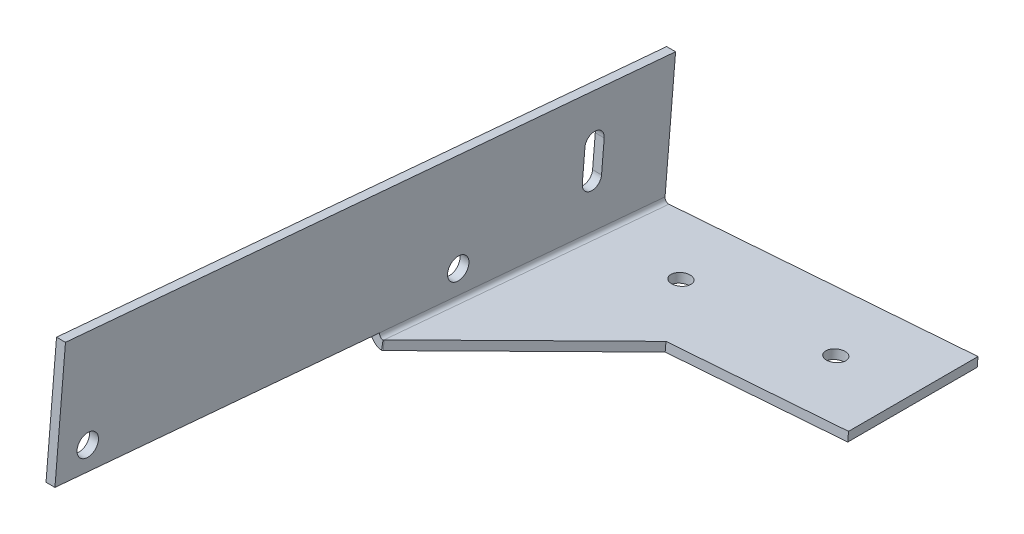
ISO-10303-21;
HEADER;
FILE_DESCRIPTION(('STEP AP214'),'2;1');
FILE_NAME('part.step','',(''),(''),'','','');
FILE_SCHEMA(('AUTOMOTIVE_DESIGN { 1 0 10303 214 1 1 1 1 }'));
ENDSEC;
DATA;
#1=APPLICATION_CONTEXT('core data for automotive mechanical design processes');
#2=APPLICATION_PROTOCOL_DEFINITION('international standard','automotive_design',2000,#1);
#3=PRODUCT_CONTEXT('',#1,'mechanical');
#4=PRODUCT('Part','Part','',(#3));
#5=PRODUCT_RELATED_PRODUCT_CATEGORY('part','',(#4));
#6=PRODUCT_DEFINITION_FORMATION('','',#4);
#7=PRODUCT_DEFINITION_CONTEXT('part definition',#1,'design');
#8=PRODUCT_DEFINITION('design','',#6,#7);
#9=PRODUCT_DEFINITION_SHAPE('','',#8);
#10=(LENGTH_UNIT() NAMED_UNIT(*) SI_UNIT(.MILLI.,.METRE.));
#11=(NAMED_UNIT(*) PLANE_ANGLE_UNIT() SI_UNIT($,.RADIAN.));
#12=(NAMED_UNIT(*) SI_UNIT($,.STERADIAN.) SOLID_ANGLE_UNIT());
#13=UNCERTAINTY_MEASURE_WITH_UNIT(LENGTH_MEASURE(1.E-05),#10,'distance_accuracy_value','');
#14=(GEOMETRIC_REPRESENTATION_CONTEXT(3) GLOBAL_UNCERTAINTY_ASSIGNED_CONTEXT((#13)) GLOBAL_UNIT_ASSIGNED_CONTEXT((#10,
#11,#12)) REPRESENTATION_CONTEXT('',''));
#15=CARTESIAN_POINT('',(0.,0.,0.));
#16=DIRECTION('',(0.,0.,1.));
#17=DIRECTION('',(1.,0.,0.));
#18=AXIS2_PLACEMENT_3D('',#15,#16,#17);
#19=CARTESIAN_POINT('',(0.,42.434925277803,1.32205070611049));
#20=DIRECTION('',(0.,0.0871557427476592,0.996194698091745));
#21=DIRECTION('',(0.,0.996194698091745,-0.0871557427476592));
#22=AXIS2_PLACEMENT_3D('',#19,#20,#21);
#23=PLANE('',#22);
#24=DIRECTION('',(1.,0.,0.));
#25=VECTOR('',#24,1.);
#26=CARTESIAN_POINT('',(0.,36.994706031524,1.79800821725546));
#27=LINE('',#26,#25);
#28=CARTESIAN_POINT('',(-1.5875,36.994706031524,1.79800821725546));
#29=VERTEX_POINT('',#28);
#30=CARTESIAN_POINT('',(0.,36.994706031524,1.79800821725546));
#31=VERTEX_POINT('',#30);
#32=EDGE_CURVE('E11',#29,#31,#27,.T.);
#33=ORIENTED_EDGE('',*,*,#32,.F.);
#34=DIRECTION('',(0.,0.996194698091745,-0.0871557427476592));
#35=VECTOR('',#34,1.);
#36=CARTESIAN_POINT('',(-1.5875,42.434925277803,1.32205070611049));
#37=LINE('',#36,#35);
#38=CARTESIAN_POINT('',(-1.5875,42.434925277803,1.32205070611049));
#39=VERTEX_POINT('',#38);
#40=EDGE_CURVE('E296',#29,#39,#37,.T.);
#41=ORIENTED_EDGE('',*,*,#40,.T.);
#42=DIRECTION('',(1.,0.,0.));
#43=VECTOR('',#42,1.);
#44=CARTESIAN_POINT('',(0.,42.434925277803,1.32205070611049));
#45=LINE('',#44,#43);
#46=CARTESIAN_POINT('',(0.,42.434925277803,1.32205070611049));
#47=VERTEX_POINT('',#46);
#48=EDGE_CURVE('E55',#39,#47,#45,.T.);
#49=ORIENTED_EDGE('',*,*,#48,.T.);
#50=DIRECTION('',(0.,0.996194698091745,-0.0871557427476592));
#51=VECTOR('',#50,1.);
#52=CARTESIAN_POINT('',(0.,42.434925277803,1.32205070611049));
#53=LINE('',#52,#51);
#54=EDGE_CURVE('E436',#31,#47,#53,.T.);
#55=ORIENTED_EDGE('',*,*,#54,.F.);
#56=EDGE_LOOP('',(#33,#41,#49,#55));
#57=FACE_BOUND('',#56,.T.);
#58=ADVANCED_FACE('F45',(#57),#23,.F.);
#59=CARTESIAN_POINT('',(0.,42.2854967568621,-0.385925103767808));
#60=DIRECTION('',(-1.,0.,0.));
#61=DIRECTION('',(0.,0.,1.));
#62=AXIS2_PLACEMENT_3D('',#59,#60,#61);
#63=CYLINDRICAL_SURFACE('',#62,1.7145);
#64=ORIENTED_EDGE('',*,*,#48,.F.);
#65=CARTESIAN_POINT('',(-1.5875,42.2854967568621,-0.385925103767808));
#66=DIRECTION('',(-1.,0.,0.));
#67=DIRECTION('',(0.,0.,1.));
#68=AXIS2_PLACEMENT_3D('',#65,#66,#67);
#69=CIRCLE('',#68,1.7145);
#70=CARTESIAN_POINT('',(-1.5875,42.1360682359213,-2.0939009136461));
#71=VERTEX_POINT('',#70);
#72=EDGE_CURVE('E237',#39,#71,#69,.T.);
#73=ORIENTED_EDGE('',*,*,#72,.T.);
#74=DIRECTION('',(1.,0.,0.));
#75=VECTOR('',#74,1.);
#76=CARTESIAN_POINT('',(0.,42.1360682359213,-2.0939009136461));
#77=LINE('',#76,#75);
#78=CARTESIAN_POINT('',(0.,42.1360682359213,-2.0939009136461));
#79=VERTEX_POINT('',#78);
#80=EDGE_CURVE('E497',#71,#79,#77,.T.);
#81=ORIENTED_EDGE('',*,*,#80,.T.);
#82=CARTESIAN_POINT('',(0.,42.2854967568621,-0.385925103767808));
#83=DIRECTION('',(-1.,0.,0.));
#84=DIRECTION('',(0.,0.,1.));
#85=AXIS2_PLACEMENT_3D('',#82,#83,#84);
#86=CIRCLE('',#85,1.7145);
#87=EDGE_CURVE('E433',#47,#79,#86,.T.);
#88=ORIENTED_EDGE('',*,*,#87,.F.);
#89=EDGE_LOOP('',(#64,#73,#81,#88));
#90=FACE_BOUND('',#89,.T.);
#91=ADVANCED_FACE('F577',(#90),#63,.F.);
#92=CARTESIAN_POINT('',(0.,42.1360682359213,-2.0939009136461));
#93=DIRECTION('',(0.,-0.0871557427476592,-0.996194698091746));
#94=DIRECTION('',(0.,-0.996194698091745,0.0871557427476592));
#95=AXIS2_PLACEMENT_3D('',#92,#93,#94);
#96=PLANE('',#95);
#97=ORIENTED_EDGE('',*,*,#80,.F.);
#98=DIRECTION('',(0.,-0.996194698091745,0.0871557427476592));
#99=VECTOR('',#98,1.);
#100=CARTESIAN_POINT('',(-1.5875,42.1360682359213,-2.0939009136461));
#101=LINE('',#100,#99);
#102=CARTESIAN_POINT('',(-1.5875,36.6958489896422,-1.61794340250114));
#103=VERTEX_POINT('',#102);
#104=EDGE_CURVE('E289',#71,#103,#101,.T.);
#105=ORIENTED_EDGE('',*,*,#104,.T.);
#106=DIRECTION('',(1.,0.,0.));
#107=VECTOR('',#106,1.);
#108=CARTESIAN_POINT('',(0.,36.6958489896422,-1.61794340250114));
#109=LINE('',#108,#107);
#110=CARTESIAN_POINT('',(0.,36.6958489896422,-1.61794340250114));
#111=VERTEX_POINT('',#110);
#112=EDGE_CURVE('E119',#103,#111,#109,.T.);
#113=ORIENTED_EDGE('',*,*,#112,.T.);
#114=DIRECTION('',(0.,-0.996194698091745,0.0871557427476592));
#115=VECTOR('',#114,1.);
#116=CARTESIAN_POINT('',(0.,42.1360682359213,-2.0939009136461));
#117=LINE('',#116,#115);
#118=EDGE_CURVE('E313',#79,#111,#117,.T.);
#119=ORIENTED_EDGE('',*,*,#118,.F.);
#120=EDGE_LOOP('',(#97,#105,#113,#119));
#121=FACE_BOUND('',#120,.T.);
#122=ADVANCED_FACE('F581',(#121),#96,.F.);
#123=CARTESIAN_POINT('',(23.6204584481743,28.9903247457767,10.5602283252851));
#124=DIRECTION('',(0.76604444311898,0.0560226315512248,0.640341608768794));
#125=DIRECTION('',(-0.642787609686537,0.0667651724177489,0.763129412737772));
#126=AXIS2_PLACEMENT_3D('',#123,#124,#125);
#127=PLANE('',#126);
#128=CARTESIAN_POINT('',(0.7366,29.78577015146,37.8667306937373));
#129=CARTESIAN_POINT('',(0.7366,31.3672292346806,37.7283709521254));
#130=B_SPLINE_CURVE_WITH_KNOTS('',1,(#128,#129),.UNSPECIFIED.,.F.,.F.,(2,2),(0.,1.),.UNSPECIFIED.);
#131=CARTESIAN_POINT('',(0.736600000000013,29.78577015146,37.8667306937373));
#132=VERTEX_POINT('',#131);
#133=CARTESIAN_POINT('',(0.736600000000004,31.3672292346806,37.7283709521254));
#134=VERTEX_POINT('',#133);
#135=EDGE_CURVE('E172',#132,#134,#130,.T.);
#136=ORIENTED_EDGE('',*,*,#135,.F.);
#137=DIRECTION('',(-0.642787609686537,0.0667651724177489,0.763129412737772));
#138=VECTOR('',#137,1.);
#139=CARTESIAN_POINT('',(23.6204584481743,27.4088656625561,10.698588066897));
#140=LINE('',#139,#138);
#141=CARTESIAN_POINT('',(23.6204584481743,27.4088656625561,10.698588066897));
#142=VERTEX_POINT('',#141);
#143=EDGE_CURVE('E288',#142,#132,#140,.T.);
#144=ORIENTED_EDGE('',*,*,#143,.F.);
#145=DIRECTION('',(0.,0.996194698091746,-0.0871557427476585));
#146=VECTOR('',#145,1.);
#147=CARTESIAN_POINT('',(23.6204584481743,28.9903247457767,10.5602283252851));
#148=LINE('',#147,#146);
#149=CARTESIAN_POINT('',(23.6204584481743,28.9903247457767,10.5602283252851));
#150=VERTEX_POINT('',#149);
#151=EDGE_CURVE('E186',#142,#150,#148,.T.);
#152=ORIENTED_EDGE('',*,*,#151,.T.);
#153=DIRECTION('',(-0.642787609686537,0.0667651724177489,0.763129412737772));
#154=VECTOR('',#153,1.);
#155=CARTESIAN_POINT('',(23.6204584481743,28.9903247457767,10.5602283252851));
#156=LINE('',#155,#154);
#157=EDGE_CURVE('E203',#150,#134,#156,.T.);
#158=ORIENTED_EDGE('',*,*,#157,.T.);
#159=EDGE_LOOP('',(#136,#144,#152,#158));
#160=FACE_BOUND('',#159,.T.);
#161=ADVANCED_FACE('F204',(#160),#127,.T.);
#162=CARTESIAN_POINT('',(53.4391783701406,28.7629528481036,7.96135564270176));
#163=DIRECTION('',(0.0871557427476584,0.0868240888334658,0.992403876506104));
#164=DIRECTION('',(-0.996194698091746,0.00759612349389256,0.0868240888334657));
#165=AXIS2_PLACEMENT_3D('',#162,#163,#164);
#166=PLANE('',#165);
#167=ORIENTED_EDGE('',*,*,#151,.F.);
#168=DIRECTION('',(0.996194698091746,-0.00759612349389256,-0.0868240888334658));
#169=VECTOR('',#168,1.);
#170=CARTESIAN_POINT('',(28.1358330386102,27.3744353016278,10.3050472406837));
#171=LINE('',#170,#169);
#172=CARTESIAN_POINT('',(53.4391783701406,27.1814937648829,8.09971538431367));
#173=VERTEX_POINT('',#172);
#174=EDGE_CURVE('E322',#173,#142,#171,.F.);
#175=ORIENTED_EDGE('',*,*,#174,.F.);
#176=DIRECTION('',(0.,0.996194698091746,-0.0871557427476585));
#177=VECTOR('',#176,1.);
#178=CARTESIAN_POINT('',(53.4391783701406,28.7629528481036,7.96135564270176));
#179=LINE('',#178,#177);
#180=CARTESIAN_POINT('',(53.4391783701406,28.7629528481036,7.96135564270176));
#181=VERTEX_POINT('',#180);
#182=EDGE_CURVE('E402',#173,#181,#179,.T.);
#183=ORIENTED_EDGE('',*,*,#182,.T.);
#184=DIRECTION('',(-0.996194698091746,0.00759612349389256,0.0868240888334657));
#185=VECTOR('',#184,1.);
#186=CARTESIAN_POINT('',(53.4391783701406,28.7629528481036,7.96135564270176));
#187=LINE('',#186,#185);
#188=EDGE_CURVE('E208',#181,#150,#187,.T.);
#189=ORIENTED_EDGE('',*,*,#188,.T.);
#190=EDGE_LOOP('',(#167,#175,#183,#189));
#191=FACE_BOUND('',#190,.T.);
#192=ADVANCED_FACE('F405',(#191),#166,.T.);
#193=CARTESIAN_POINT('',(51.22542250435,26.5576209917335,-17.2457028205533));
#194=DIRECTION('',(0.996194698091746,-0.00759612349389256,-0.0868240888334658));
#195=DIRECTION('',(0.0871557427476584,0.0868240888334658,0.992403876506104));
#196=AXIS2_PLACEMENT_3D('',#193,#194,#195);
#197=PLANE('',#196);
#198=ORIENTED_EDGE('',*,*,#182,.F.);
#199=DIRECTION('',(-0.0871557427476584,-0.0868240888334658,-0.992403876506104));
#200=VECTOR('',#199,1.);
#201=CARTESIAN_POINT('',(52.3323004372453,26.0788278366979,-4.50381384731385));
#202=LINE('',#201,#200);
#203=CARTESIAN_POINT('',(51.2254225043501,24.9761619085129,-17.1073430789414));
#204=VERTEX_POINT('',#203);
#205=EDGE_CURVE('E255',#204,#173,#202,.F.);
#206=ORIENTED_EDGE('',*,*,#205,.F.);
#207=DIRECTION('',(0.,0.996194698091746,-0.0871557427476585));
#208=VECTOR('',#207,1.);
#209=CARTESIAN_POINT('',(51.22542250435,26.5576209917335,-17.2457028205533));
#210=LINE('',#209,#208);
#211=CARTESIAN_POINT('',(51.22542250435,26.5576209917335,-17.2457028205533));
#212=VERTEX_POINT('',#211);
#213=EDGE_CURVE('E395',#204,#212,#210,.T.);
#214=ORIENTED_EDGE('',*,*,#213,.T.);
#215=DIRECTION('',(0.0871557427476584,0.0868240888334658,0.992403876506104));
#216=VECTOR('',#215,1.);
#217=CARTESIAN_POINT('',(51.22542250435,26.5576209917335,-17.2457028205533));
#218=LINE('',#217,#216);
#219=EDGE_CURVE('E218',#212,#181,#218,.T.);
#220=ORIENTED_EDGE('',*,*,#219,.T.);
#221=EDGE_LOOP('',(#198,#206,#214,#220));
#222=FACE_BOUND('',#221,.T.);
#223=ADVANCED_FACE('F412',(#222),#197,.T.);
#224=CARTESIAN_POINT('',(51.22542250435,26.5576209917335,-17.2457028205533));
#225=DIRECTION('',(-0.0871557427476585,-0.0868240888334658,-0.992403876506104));
#226=DIRECTION('',(0.996194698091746,-0.00759612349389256,-0.0868240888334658));
#227=AXIS2_PLACEMENT_3D('',#224,#225,#226);
#228=PLANE('',#227);
#229=ORIENTED_EDGE('',*,*,#213,.F.);
#230=DIRECTION('',(0.996194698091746,-0.00759612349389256,-0.0868240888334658));
#231=VECTOR('',#230,1.);
#232=CARTESIAN_POINT('',(25.9220771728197,25.1691034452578,-14.9020112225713));
#233=LINE('',#232,#231);
#234=CARTESIAN_POINT('',(0.736599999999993,25.3611462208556,-12.70695225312));
#235=VERTEX_POINT('',#234);
#236=EDGE_CURVE('E303',#235,#204,#233,.T.);
#237=ORIENTED_EDGE('',*,*,#236,.F.);
#238=CARTESIAN_POINT('',(0.7366,26.9426053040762,-12.845311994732));
#239=CARTESIAN_POINT('',(0.7366,25.3611462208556,-12.7069522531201));
#240=B_SPLINE_CURVE_WITH_KNOTS('',1,(#238,#239),.UNSPECIFIED.,.F.,.F.,(2,2),(0.,1.),.UNSPECIFIED.);
#241=CARTESIAN_POINT('',(0.736599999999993,26.9426053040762,-12.8453119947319));
#242=VERTEX_POINT('',#241);
#243=EDGE_CURVE('E383',#235,#242,#240,.F.);
#244=ORIENTED_EDGE('',*,*,#243,.T.);
#245=DIRECTION('',(0.996194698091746,-0.00759612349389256,-0.0868240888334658));
#246=VECTOR('',#245,1.);
#247=CARTESIAN_POINT('',(51.22542250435,26.5576209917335,-17.2457028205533));
#248=LINE('',#247,#246);
#249=EDGE_CURVE('E215',#242,#212,#248,.T.);
#250=ORIENTED_EDGE('',*,*,#249,.T.);
#251=EDGE_LOOP('',(#229,#237,#244,#250));
#252=FACE_BOUND('',#251,.T.);
#253=ADVANCED_FACE('F344',(#252),#228,.T.);
#254=CARTESIAN_POINT('',(0.7366,25.3611462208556,-12.7069522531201));
#255=CARTESIAN_POINT('',(0.676932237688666,25.3614458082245,-12.7035279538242));
#256=CARTESIAN_POINT('',(0.61726470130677,25.3640355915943,-12.7003040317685));
#257=CARTESIAN_POINT('',(0.557773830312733,25.3689088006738,-12.6972798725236));
#258=CARTESIAN_POINT('',(0.7366,26.9426053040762,-12.845311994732));
#259=CARTESIAN_POINT('',(0.717688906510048,26.942904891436,-12.8418876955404));
#260=CARTESIAN_POINT('',(0.698777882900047,26.943930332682,-12.8385269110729));
#261=CARTESIAN_POINT('',(0.679922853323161,26.9456794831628,-12.8352294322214));
#262=B_SPLINE_SURFACE_WITH_KNOTS('',1,3,((#254,#255,#256,#257),(#258,#259,#260,#261)),
.UNSPECIFIED.,.F.,.F.,.F.,(2,2),(4,4),(0.,1.),(0.,1.),.UNSPECIFIED.);
#263=CARTESIAN_POINT('',(0.7366,25.3611462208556,-12.7069522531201));
#264=CARTESIAN_POINT('',(0.676932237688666,25.3614458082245,-12.7035279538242));
#265=CARTESIAN_POINT('',(0.61726470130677,25.3640355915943,-12.7003040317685));
#266=CARTESIAN_POINT('',(0.557773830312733,25.3689088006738,-12.6972798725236));
#267=B_SPLINE_CURVE_WITH_KNOTS('',3,(#263,#264,#265,#266),.UNSPECIFIED.,.F.,.F.,(4,4),(0.,1.),.UNSPECIFIED.);
#268=CARTESIAN_POINT('',(0.557773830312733,25.3689088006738,-12.6972798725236));
#269=VERTEX_POINT('',#268);
#270=EDGE_CURVE('E249',#235,#269,#267,.T.);
#271=CARTESIAN_POINT('',(0.557773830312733,25.3689088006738,-12.6972798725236));
#272=CARTESIAN_POINT('',(0.679922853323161,26.9456794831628,-12.8352294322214));
#273=B_SPLINE_CURVE_WITH_KNOTS('',1,(#271,#272),.UNSPECIFIED.,.F.,.F.,(2,2),(0.,1.),.UNSPECIFIED.);
#274=CARTESIAN_POINT('',(0.679922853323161,26.9456794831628,-12.8352294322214));
#275=VERTEX_POINT('',#274);
#276=EDGE_CURVE('E64',#269,#275,#273,.T.);
#277=CARTESIAN_POINT('',(0.679922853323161,26.9456794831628,-12.8352294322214));
#278=CARTESIAN_POINT('',(0.698777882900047,26.943930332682,-12.8385269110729));
#279=CARTESIAN_POINT('',(0.717688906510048,26.942904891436,-12.8418876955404));
#280=CARTESIAN_POINT('',(0.7366,26.9426053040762,-12.845311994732));
#281=B_SPLINE_CURVE_WITH_KNOTS('',3,(#277,#278,#279,#280),.UNSPECIFIED.,.F.,.F.,(4,4),(0.,1.),.UNSPECIFIED.);
#282=EDGE_CURVE('E199',#242,#275,#281,.F.);
#283=ORIENTED_EDGE('',*,*,#243,.F.);
#284=ORIENTED_EDGE('',*,*,#270,.T.);
#285=ORIENTED_EDGE('',*,*,#276,.T.);
#286=ORIENTED_EDGE('',*,*,#282,.F.);
#287=EDGE_LOOP('',(#283,#284,#285,#286));
#288=FACE_BOUND('',#287,.T.);
#289=ADVANCED_FACE('F331',(#288),#262,.F.);
#290=CARTESIAN_POINT('',(0.7366,27.6773010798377,-12.8992380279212));
#291=DIRECTION('',(0.,-0.0871557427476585,-0.996194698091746));
#292=DIRECTION('',(0.,0.996194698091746,-0.0871557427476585));
#293=AXIS2_PLACEMENT_3D('',#290,#291,#292);
#294=PLANE('',#293);
#295=ORIENTED_EDGE('',*,*,#276,.F.);
#296=CARTESIAN_POINT('',(0.7366,27.6773010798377,-12.8992380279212));
#297=DIRECTION('',(0.,-0.0871557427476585,-0.996194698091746));
#298=DIRECTION('',(0.,0.996194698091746,-0.0871557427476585));
#299=AXIS2_PLACEMENT_3D('',#296,#297,#298);
#300=CIRCLE('',#299,2.3241);
#301=CARTESIAN_POINT('',(-1.5875,27.6773010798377,-12.8992380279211));
#302=VERTEX_POINT('',#301);
#303=EDGE_CURVE('E310',#269,#302,#300,.T.);
#304=ORIENTED_EDGE('',*,*,#303,.T.);
#305=DIRECTION('',(1.,0.,0.));
#306=VECTOR('',#305,1.);
#307=CARTESIAN_POINT('',(0.,27.6773010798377,-12.8992380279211));
#308=LINE('',#307,#306);
#309=CARTESIAN_POINT('',(0.,27.6773010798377,-12.8992380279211));
#310=VERTEX_POINT('',#309);
#311=EDGE_CURVE('E459',#302,#310,#308,.T.);
#312=ORIENTED_EDGE('',*,*,#311,.T.);
#313=CARTESIAN_POINT('',(0.7366,27.6773010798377,-12.8992380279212));
#314=DIRECTION('',(0.,0.0871557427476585,0.996194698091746));
#315=DIRECTION('',(0.,-0.996194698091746,0.0871557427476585));
#316=AXIS2_PLACEMENT_3D('',#313,#314,#315);
#317=CIRCLE('',#316,0.7366);
#318=EDGE_CURVE('E227',#275,#310,#317,.F.);
#319=ORIENTED_EDGE('',*,*,#318,.F.);
#320=EDGE_LOOP('',(#295,#304,#312,#319));
#321=FACE_BOUND('',#320,.T.);
#322=ADVANCED_FACE('F343',(#321),#294,.T.);
#323=CARTESIAN_POINT('',(0.,25.4,-12.7));
#324=DIRECTION('',(0.,-0.0871557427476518,-0.996194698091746));
#325=DIRECTION('',(0.,-0.996194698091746,0.0871557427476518));
#326=AXIS2_PLACEMENT_3D('',#323,#324,#325);
#327=PLANE('',#326);
#328=ORIENTED_EDGE('',*,*,#311,.F.);
#329=DIRECTION('',(0.,-0.996194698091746,0.0871557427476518));
#330=VECTOR('',#329,1.);
#331=CARTESIAN_POINT('',(-1.5875,25.4,-12.7));
#332=LINE('',#331,#330);
#333=CARTESIAN_POINT('',(-1.5875,49.0586278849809,-14.769861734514));
#334=VERTEX_POINT('',#333);
#335=EDGE_CURVE('E236',#334,#302,#332,.T.);
#336=ORIENTED_EDGE('',*,*,#335,.F.);
#337=DIRECTION('',(1.,0.,0.));
#338=VECTOR('',#337,1.);
#339=CARTESIAN_POINT('',(0.,49.0586278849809,-14.769861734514));
#340=LINE('',#339,#338);
#341=CARTESIAN_POINT('',(0.,49.0586278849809,-14.769861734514));
#342=VERTEX_POINT('',#341);
#343=EDGE_CURVE('E462',#334,#342,#340,.T.);
#344=ORIENTED_EDGE('',*,*,#343,.T.);
#345=DIRECTION('',(0.,-0.996194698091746,0.0871557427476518));
#346=VECTOR('',#345,1.);
#347=CARTESIAN_POINT('',(0.,25.4,-12.7));
#348=LINE('',#347,#346);
#349=EDGE_CURVE('E427',#342,#310,#348,.T.);
#350=ORIENTED_EDGE('',*,*,#349,.T.);
#351=EDGE_LOOP('',(#328,#336,#344,#350));
#352=FACE_BOUND('',#351,.T.);
#353=ADVANCED_FACE('F464',(#352),#327,.T.);
#354=CARTESIAN_POINT('',(0.,49.0586278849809,-14.769861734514));
#355=DIRECTION('',(0.,0.996194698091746,-0.0871557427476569));
#356=DIRECTION('',(0.,-0.0871557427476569,-0.996194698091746));
#357=AXIS2_PLACEMENT_3D('',#354,#355,#356);
#358=PLANE('',#357);
#359=ORIENTED_EDGE('',*,*,#343,.F.);
#360=DIRECTION('',(0.,-0.0871557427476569,-0.996194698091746));
#361=VECTOR('',#360,1.);
#362=CARTESIAN_POINT('',(-1.5875,49.0586278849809,-14.769861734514));
#363=LINE('',#362,#361);
#364=CARTESIAN_POINT('',(-1.5875,58.5374919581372,93.5740503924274));
#365=VERTEX_POINT('',#364);
#366=EDGE_CURVE('E240',#365,#334,#363,.T.);
#367=ORIENTED_EDGE('',*,*,#366,.F.);
#368=DIRECTION('',(1.,0.,0.));
#369=VECTOR('',#368,1.);
#370=CARTESIAN_POINT('',(-1.5875,58.5374919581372,93.5740503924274));
#371=LINE('',#370,#369);
#372=CARTESIAN_POINT('',(0.,58.5374919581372,93.5740503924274));
#373=VERTEX_POINT('',#372);
#374=EDGE_CURVE('E472',#365,#373,#371,.T.);
#375=ORIENTED_EDGE('',*,*,#374,.T.);
#376=DIRECTION('',(0.,-0.0871557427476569,-0.996194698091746));
#377=VECTOR('',#376,1.);
#378=CARTESIAN_POINT('',(0.,49.0586278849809,-14.769861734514));
#379=LINE('',#378,#377);
#380=EDGE_CURVE('E424',#373,#342,#379,.T.);
#381=ORIENTED_EDGE('',*,*,#380,.T.);
#382=EDGE_LOOP('',(#359,#367,#375,#381));
#383=FACE_BOUND('',#382,.T.);
#384=ADVANCED_FACE('F470',(#383),#358,.T.);
#385=CARTESIAN_POINT('',(0.,32.2239567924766,39.0692745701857));
#386=DIRECTION('',(0.,-0.996194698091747,0.0871557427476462));
#387=DIRECTION('',(0.,0.0871557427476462,0.996194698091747));
#388=AXIS2_PLACEMENT_3D('',#385,#386,#387);
#389=PLANE('',#388);
#390=DIRECTION('',(0.,0.0871557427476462,0.996194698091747));
#391=VECTOR('',#390,1.);
#392=CARTESIAN_POINT('',(0.,32.2239567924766,39.0692745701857));
#393=LINE('',#392,#391);
#394=CARTESIAN_POINT('',(0.,32.1132689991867,37.8041073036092));
#395=VERTEX_POINT('',#394);
#396=CARTESIAN_POINT('',(0.,37.156165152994,95.4446740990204));
#397=VERTEX_POINT('',#396);
#398=EDGE_CURVE('E422',#395,#397,#393,.T.);
#399=ORIENTED_EDGE('',*,*,#398,.T.);
#400=DIRECTION('',(1.,0.,0.));
#401=VECTOR('',#400,1.);
#402=CARTESIAN_POINT('',(-1.5875,37.156165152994,95.4446740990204));
#403=LINE('',#402,#401);
#404=CARTESIAN_POINT('',(-1.5875,37.156165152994,95.4446740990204));
#405=VERTEX_POINT('',#404);
#406=EDGE_CURVE('E293',#405,#397,#403,.T.);
#407=ORIENTED_EDGE('',*,*,#406,.F.);
#408=DIRECTION('',(0.,0.0871557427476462,0.996194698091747));
#409=VECTOR('',#408,1.);
#410=CARTESIAN_POINT('',(-1.5875,32.2239567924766,39.0692745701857));
#411=LINE('',#410,#409);
#412=CARTESIAN_POINT('',(-1.5875,32.1132689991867,37.8041073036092));
#413=VERTEX_POINT('',#412);
#414=EDGE_CURVE('E128',#413,#405,#411,.T.);
#415=ORIENTED_EDGE('',*,*,#414,.F.);
#416=DIRECTION('',(1.,0.,0.));
#417=VECTOR('',#416,1.);
#418=CARTESIAN_POINT('',(0.,32.1132689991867,37.8041073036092));
#419=LINE('',#418,#417);
#420=EDGE_CURVE('E795',#413,#395,#419,.T.);
#421=ORIENTED_EDGE('',*,*,#420,.T.);
#422=EDGE_LOOP('',(#399,#407,#415,#421));
#423=FACE_BOUND('',#422,.T.);
#424=ADVANCED_FACE('F566',(#423),#389,.T.);
#425=CARTESIAN_POINT('',(0.7366,32.1132689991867,37.8041073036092));
#426=DIRECTION('',(0.,-0.0871557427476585,-0.996194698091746));
#427=DIRECTION('',(0.,0.996194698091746,-0.0871557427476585));
#428=AXIS2_PLACEMENT_3D('',#425,#426,#427);
#429=PLANE('',#428);
#430=ORIENTED_EDGE('',*,*,#420,.F.);
#431=CARTESIAN_POINT('',(0.7366,32.1132689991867,37.8041073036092));
#432=DIRECTION('',(0.,-0.0871557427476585,-0.996194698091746));
#433=DIRECTION('',(0.,0.996194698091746,-0.0871557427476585));
#434=AXIS2_PLACEMENT_3D('',#431,#432,#433);
#435=CIRCLE('',#434,2.3241);
#436=CARTESIAN_POINT('',(0.557773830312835,29.8048767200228,38.0060654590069));
#437=VERTEX_POINT('',#436);
#438=EDGE_CURVE('E302',#413,#437,#435,.F.);
#439=ORIENTED_EDGE('',*,*,#438,.T.);
#440=CARTESIAN_POINT('',(0.679922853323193,31.3816474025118,37.868115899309));
#441=CARTESIAN_POINT('',(0.557773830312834,29.8048767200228,38.0060654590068));
#442=B_SPLINE_CURVE_WITH_KNOTS('',1,(#440,#441),.UNSPECIFIED.,.F.,.F.,(2,2),(0.,1.),.UNSPECIFIED.);
#443=CARTESIAN_POINT('',(0.679922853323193,31.3816474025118,37.868115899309));
#444=VERTEX_POINT('',#443);
#445=EDGE_CURVE('E230',#437,#444,#442,.F.);
#446=ORIENTED_EDGE('',*,*,#445,.T.);
#447=CARTESIAN_POINT('',(0.7366,32.1132689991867,37.8041073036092));
#448=DIRECTION('',(0.,0.0871557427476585,0.996194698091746));
#449=DIRECTION('',(0.,-0.996194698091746,0.0871557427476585));
#450=AXIS2_PLACEMENT_3D('',#447,#448,#449);
#451=CIRCLE('',#450,0.7366);
#452=EDGE_CURVE('E198',#395,#444,#451,.T.);
#453=ORIENTED_EDGE('',*,*,#452,.F.);
#454=EDGE_LOOP('',(#430,#439,#446,#453));
#455=FACE_BOUND('',#454,.T.);
#456=ADVANCED_FACE('F557',(#455),#429,.F.);
#457=CARTESIAN_POINT('',(0.,36.8452775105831,0.0900324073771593));
#458=DIRECTION('',(-1.,0.,0.));
#459=DIRECTION('',(0.,0.,1.));
#460=AXIS2_PLACEMENT_3D('',#457,#458,#459);
#461=CYLINDRICAL_SURFACE('',#460,1.7145);
#462=CARTESIAN_POINT('',(-1.5875,36.8452775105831,0.0900324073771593));
#463=DIRECTION('',(-1.,0.,0.));
#464=DIRECTION('',(0.,0.,1.));
#465=AXIS2_PLACEMENT_3D('',#462,#463,#464);
#466=CIRCLE('',#465,1.7145);
#467=EDGE_CURVE('E292',#103,#29,#466,.T.);
#468=ORIENTED_EDGE('',*,*,#467,.T.);
#469=ORIENTED_EDGE('',*,*,#32,.T.);
#470=CARTESIAN_POINT('',(0.,36.8452775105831,0.0900324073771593));
#471=DIRECTION('',(-1.,0.,0.));
#472=DIRECTION('',(0.,0.,1.));
#473=AXIS2_PLACEMENT_3D('',#470,#471,#472);
#474=CIRCLE('',#473,1.7145);
#475=EDGE_CURVE('E439',#111,#31,#474,.T.);
#476=ORIENTED_EDGE('',*,*,#475,.F.);
#477=ORIENTED_EDGE('',*,*,#112,.F.);
#478=EDGE_LOOP('',(#468,#469,#476,#477));
#479=FACE_BOUND('',#478,.T.);
#480=ADVANCED_FACE('F47',(#479),#461,.F.);
#481=CARTESIAN_POINT('',(14.3772824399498,27.9496992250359,-1.33417580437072));
#482=DIRECTION('',(0.,-0.996194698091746,0.0871557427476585));
#483=DIRECTION('',(0.,-0.0871557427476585,-0.996194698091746));
#484=AXIS2_PLACEMENT_3D('',#481,#482,#483);
#485=CYLINDRICAL_SURFACE('',#484,1.651);
#486=CARTESIAN_POINT('',(14.3772824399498,27.9496992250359,-1.33417580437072));
#487=DIRECTION('',(0.,-0.996194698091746,0.0871557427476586));
#488=DIRECTION('',(0.,-0.0871557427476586,-0.996194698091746));
#489=AXIS2_PLACEMENT_3D('',#486,#487,#488);
#490=CIRCLE('',#489,1.651);
#491=CARTESIAN_POINT('',(14.3772824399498,27.8058050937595,-2.97889325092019));
#492=VERTEX_POINT('',#491);
#493=EDGE_CURVE('E419',#492,#492,#490,.T.);
#494=ORIENTED_EDGE('',*,*,#493,.F.);
#495=EDGE_LOOP('',(#494));
#496=FACE_BOUND('',#495,.T.);
#497=CARTESIAN_POINT('',(14.3772824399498,26.3682401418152,-1.19581606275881));
#498=DIRECTION('',(0.,-0.996194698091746,0.0871557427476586));
#499=DIRECTION('',(0.,-0.0871557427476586,-0.996194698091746));
#500=AXIS2_PLACEMENT_3D('',#497,#498,#499);
#501=CIRCLE('',#500,1.651);
#502=CARTESIAN_POINT('',(14.3772824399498,26.2243460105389,-2.84053350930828));
#503=VERTEX_POINT('',#502);
#504=EDGE_CURVE('E239',#503,#503,#501,.T.);
#505=ORIENTED_EDGE('',*,*,#504,.T.);
#506=EDGE_LOOP('',(#505));
#507=FACE_BOUND('',#506,.T.);
#508=ADVANCED_FACE('F520',(#496,#507),#485,.F.);
#509=CARTESIAN_POINT('',(39.6806277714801,27.756757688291,-3.53950766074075));
#510=DIRECTION('',(0.,-0.996194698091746,0.0871557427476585));
#511=DIRECTION('',(0.,-0.0871557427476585,-0.996194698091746));
#512=AXIS2_PLACEMENT_3D('',#509,#510,#511);
#513=CYLINDRICAL_SURFACE('',#512,1.651);
#514=CARTESIAN_POINT('',(39.6806277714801,27.756757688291,-3.53950766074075));
#515=DIRECTION('',(0.,-0.996194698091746,0.0871557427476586));
#516=DIRECTION('',(0.,-0.0871557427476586,-0.996194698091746));
#517=AXIS2_PLACEMENT_3D('',#514,#515,#516);
#518=CIRCLE('',#517,1.651);
#519=CARTESIAN_POINT('',(39.6806277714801,27.6128635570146,-5.18422510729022));
#520=VERTEX_POINT('',#519);
#521=EDGE_CURVE('E209',#520,#520,#518,.T.);
#522=ORIENTED_EDGE('',*,*,#521,.F.);
#523=EDGE_LOOP('',(#522));
#524=FACE_BOUND('',#523,.T.);
#525=CARTESIAN_POINT('',(39.6806277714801,26.1752986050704,-3.40114791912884));
#526=DIRECTION('',(0.,-0.996194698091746,0.0871557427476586));
#527=DIRECTION('',(0.,-0.0871557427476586,-0.996194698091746));
#528=AXIS2_PLACEMENT_3D('',#525,#526,#527);
#529=CIRCLE('',#528,1.651);
#530=CARTESIAN_POINT('',(39.6806277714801,26.031404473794,-5.04586536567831));
#531=VERTEX_POINT('',#530);
#532=EDGE_CURVE('E285',#531,#531,#529,.T.);
#533=ORIENTED_EDGE('',*,*,#532,.T.);
#534=EDGE_LOOP('',(#533));
#535=FACE_BOUND('',#534,.T.);
#536=ADVANCED_FACE('F517',(#524,#535),#513,.F.);
#537=CARTESIAN_POINT('',(0.557773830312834,29.8048767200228,38.0060654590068));
#538=CARTESIAN_POINT('',(0.617264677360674,29.7962221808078,37.9598204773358));
#539=CARTESIAN_POINT('',(0.67693226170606,29.7898510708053,37.9133758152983));
#540=CARTESIAN_POINT('',(0.7366,29.78577015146,37.8667306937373));
#541=CARTESIAN_POINT('',(0.679922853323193,31.3816474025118,37.868115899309));
#542=CARTESIAN_POINT('',(0.698777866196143,31.3761169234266,37.8215976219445));
#543=CARTESIAN_POINT('',(0.717688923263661,31.371310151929,37.7750160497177));
#544=CARTESIAN_POINT('',(0.7366,31.3672292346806,37.7283709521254));
#545=B_SPLINE_SURFACE_WITH_KNOTS('',1,3,((#537,#538,#539,#540),(#541,#542,#543,#544)),
.UNSPECIFIED.,.F.,.F.,.F.,(2,2),(4,4),(0.,1.),(0.,1.),.UNSPECIFIED.);
#546=CARTESIAN_POINT('',(0.557773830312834,29.8048767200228,38.0060654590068));
#547=CARTESIAN_POINT('',(0.617264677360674,29.7962221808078,37.9598204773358));
#548=CARTESIAN_POINT('',(0.67693226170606,29.7898510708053,37.9133758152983));
#549=CARTESIAN_POINT('',(0.7366,29.78577015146,37.8667306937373));
#550=B_SPLINE_CURVE_WITH_KNOTS('',3,(#546,#547,#548,#549),.UNSPECIFIED.,.F.,.F.,(4,4),(0.,1.),.UNSPECIFIED.);
#551=EDGE_CURVE('E179',#437,#132,#550,.T.);
#552=CARTESIAN_POINT('',(0.7366,31.3672292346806,37.7283709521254));
#553=CARTESIAN_POINT('',(0.717688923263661,31.371310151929,37.7750160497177));
#554=CARTESIAN_POINT('',(0.698777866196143,31.3761169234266,37.8215976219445));
#555=CARTESIAN_POINT('',(0.679922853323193,31.3816474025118,37.868115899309));
#556=B_SPLINE_CURVE_WITH_KNOTS('',3,(#552,#553,#554,#555),.UNSPECIFIED.,.F.,.F.,(4,4),(0.,1.),.UNSPECIFIED.);
#557=EDGE_CURVE('E176',#444,#134,#556,.F.);
#558=ORIENTED_EDGE('',*,*,#551,.T.);
#559=ORIENTED_EDGE('',*,*,#135,.T.);
#560=ORIENTED_EDGE('',*,*,#557,.F.);
#561=ORIENTED_EDGE('',*,*,#445,.F.);
#562=EDGE_LOOP('',(#558,#559,#560,#561));
#563=FACE_BOUND('',#562,.T.);
#564=ADVANCED_FACE('F175',(#563),#545,.F.);
#565=CARTESIAN_POINT('',(0.7366,34.3736518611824,63.6404016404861));
#566=DIRECTION('',(0.,-0.0871557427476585,-0.996194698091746));
#567=DIRECTION('',(0.,-0.996194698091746,0.0871557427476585));
#568=AXIS2_PLACEMENT_3D('',#565,#566,#567);
#569=CYLINDRICAL_SURFACE('',#568,0.7366);
#570=DIRECTION('',(0.,-0.0871557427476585,-0.996194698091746));
#571=VECTOR('',#570,1.);
#572=CARTESIAN_POINT('',(0.,28.5870254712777,-2.50104065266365));
#573=LINE('',#572,#571);
#574=EDGE_CURVE('E430',#395,#310,#573,.T.);
#575=ORIENTED_EDGE('',*,*,#574,.F.);
#576=ORIENTED_EDGE('',*,*,#452,.T.);
#577=ORIENTED_EDGE('',*,*,#557,.T.);
#578=DIRECTION('',(0.,-0.0871557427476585,-0.996194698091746));
#579=VECTOR('',#578,1.);
#580=CARTESIAN_POINT('',(0.7366,27.8532284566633,-2.43684173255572));
#581=LINE('',#580,#579);
#582=EDGE_CURVE('E196',#134,#242,#581,.T.);
#583=ORIENTED_EDGE('',*,*,#582,.T.);
#584=ORIENTED_EDGE('',*,*,#282,.T.);
#585=ORIENTED_EDGE('',*,*,#318,.T.);
#586=EDGE_LOOP('',(#575,#576,#577,#583,#584,#585));
#587=FACE_BOUND('',#586,.T.);
#588=ADVANCED_FACE('F194',(#587),#569,.F.);
#589=CARTESIAN_POINT('',(27.028955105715,27.8532284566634,-2.43684173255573));
#590=DIRECTION('',(0.,-0.996194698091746,0.0871557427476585));
#591=DIRECTION('',(-0.0871557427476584,-0.0868240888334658,-0.992403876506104));
#592=AXIS2_PLACEMENT_3D('',#589,#590,#591);
#593=PLANE('',#592);
#594=ORIENTED_EDGE('',*,*,#493,.T.);
#595=EDGE_LOOP('',(#594));
#596=FACE_BOUND('',#595,.T.);
#597=ORIENTED_EDGE('',*,*,#521,.T.);
#598=EDGE_LOOP('',(#597));
#599=FACE_BOUND('',#598,.T.);
#600=ORIENTED_EDGE('',*,*,#157,.F.);
#601=ORIENTED_EDGE('',*,*,#188,.F.);
#602=ORIENTED_EDGE('',*,*,#219,.F.);
#603=ORIENTED_EDGE('',*,*,#249,.F.);
#604=ORIENTED_EDGE('',*,*,#582,.F.);
#605=EDGE_LOOP('',(#600,#601,#602,#603,#604));
#606=FACE_BOUND('',#605,.T.);
#607=ADVANCED_FACE('F212',(#596,#599,#606),#593,.F.);
#608=CARTESIAN_POINT('',(0.,0.,0.));
#609=DIRECTION('',(-1.,0.,0.));
#610=DIRECTION('',(0.,0.,-1.));
#611=AXIS2_PLACEMENT_3D('',#608,#609,#610);
#612=PLANE('',#611);
#613=CARTESIAN_POINT('',(0.,40.7799833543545,89.6163545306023));
#614=DIRECTION('',(1.,0.,0.));
#615=DIRECTION('',(0.,0.,-1.));
#616=AXIS2_PLACEMENT_3D('',#613,#614,#615);
#617=CIRCLE('',#616,1.90500000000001);
#618=CARTESIAN_POINT('',(0.,40.7799833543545,87.7113545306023));
#619=VERTEX_POINT('',#618);
#620=EDGE_CURVE('E489',#619,#619,#617,.T.);
#621=ORIENTED_EDGE('',*,*,#620,.F.);
#622=EDGE_LOOP('',(#621));
#623=FACE_BOUND('',#622,.T.);
#624=CARTESIAN_POINT('',(0.,35.024218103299,23.8276566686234));
#625=DIRECTION('',(1.,0.,0.));
#626=DIRECTION('',(0.,0.,-1.));
#627=AXIS2_PLACEMENT_3D('',#624,#625,#626);
#628=CIRCLE('',#627,1.905);
#629=CARTESIAN_POINT('',(0.,35.024218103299,21.9226566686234));
#630=VERTEX_POINT('',#629);
#631=EDGE_CURVE('E486',#630,#630,#628,.T.);
#632=ORIENTED_EDGE('',*,*,#631,.F.);
#633=EDGE_LOOP('',(#632));
#634=FACE_BOUND('',#633,.T.);
#635=ORIENTED_EDGE('',*,*,#118,.T.);
#636=ORIENTED_EDGE('',*,*,#475,.T.);
#637=ORIENTED_EDGE('',*,*,#54,.T.);
#638=ORIENTED_EDGE('',*,*,#87,.T.);
#639=EDGE_LOOP('',(#635,#636,#637,#638));
#640=FACE_BOUND('',#639,.T.);
#641=ORIENTED_EDGE('',*,*,#574,.T.);
#642=ORIENTED_EDGE('',*,*,#349,.F.);
#643=ORIENTED_EDGE('',*,*,#380,.F.);
#644=DIRECTION('',(0.,-0.996194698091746,0.0871557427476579));
#645=VECTOR('',#644,1.);
#646=CARTESIAN_POINT('',(0.,8.56913968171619,97.945714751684));
#647=LINE('',#646,#645);
#648=EDGE_CURVE('E478',#373,#397,#647,.T.);
#649=ORIENTED_EDGE('',*,*,#648,.T.);
#650=ORIENTED_EDGE('',*,*,#398,.F.);
#651=EDGE_LOOP('',(#641,#642,#643,#649,#650));
#652=FACE_BOUND('',#651,.T.);
#653=ADVANCED_FACE('F268',(#623,#634,#640,#652),#612,.F.);
#654=CARTESIAN_POINT('',(0.7366,34.3736518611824,63.6404016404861));
#655=DIRECTION('',(0.,-0.0871557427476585,-0.996194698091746));
#656=DIRECTION('',(0.,-0.996194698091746,0.0871557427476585));
#657=AXIS2_PLACEMENT_3D('',#654,#655,#656);
#658=CYLINDRICAL_SURFACE('',#657,2.3241);
#659=DIRECTION('',(0.,-0.0871557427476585,-0.996194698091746));
#660=VECTOR('',#659,1.);
#661=CARTESIAN_POINT('',(-1.5875,34.3736518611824,63.6404016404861));
#662=LINE('',#661,#660);
#663=EDGE_CURVE('E233',#413,#302,#662,.T.);
#664=ORIENTED_EDGE('',*,*,#663,.T.);
#665=ORIENTED_EDGE('',*,*,#303,.F.);
#666=ORIENTED_EDGE('',*,*,#270,.F.);
#667=DIRECTION('',(0.,-0.0871557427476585,-0.996194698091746));
#668=VECTOR('',#667,1.);
#669=CARTESIAN_POINT('',(0.736600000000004,32.0583957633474,63.8429603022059));
#670=LINE('',#669,#668);
#671=EDGE_CURVE('E299',#132,#235,#670,.T.);
#672=ORIENTED_EDGE('',*,*,#671,.F.);
#673=ORIENTED_EDGE('',*,*,#551,.F.);
#674=ORIENTED_EDGE('',*,*,#438,.F.);
#675=EDGE_LOOP('',(#664,#665,#666,#672,#673,#674));
#676=FACE_BOUND('',#675,.T.);
#677=ADVANCED_FACE('F257',(#676),#658,.T.);
#678=CARTESIAN_POINT('',(27.028955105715,26.2717693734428,-2.29848199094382));
#679=DIRECTION('',(0.,-0.996194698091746,0.0871557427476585));
#680=DIRECTION('',(-0.0871557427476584,-0.0868240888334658,-0.992403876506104));
#681=AXIS2_PLACEMENT_3D('',#678,#679,#680);
#682=PLANE('',#681);
#683=ORIENTED_EDGE('',*,*,#504,.F.);
#684=EDGE_LOOP('',(#683));
#685=FACE_BOUND('',#684,.T.);
#686=ORIENTED_EDGE('',*,*,#532,.F.);
#687=EDGE_LOOP('',(#686));
#688=FACE_BOUND('',#687,.T.);
#689=ORIENTED_EDGE('',*,*,#143,.T.);
#690=ORIENTED_EDGE('',*,*,#671,.T.);
#691=ORIENTED_EDGE('',*,*,#236,.T.);
#692=ORIENTED_EDGE('',*,*,#205,.T.);
#693=ORIENTED_EDGE('',*,*,#174,.T.);
#694=EDGE_LOOP('',(#689,#690,#691,#692,#693));
#695=FACE_BOUND('',#694,.T.);
#696=ADVANCED_FACE('F267',(#685,#688,#695),#682,.T.);
#697=CARTESIAN_POINT('',(-1.5875,0.,0.));
#698=DIRECTION('',(-1.,0.,0.));
#699=DIRECTION('',(0.,0.,-1.));
#700=AXIS2_PLACEMENT_3D('',#697,#698,#699);
#701=PLANE('',#700);
#702=CARTESIAN_POINT('',(-1.5875,40.7799833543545,89.6163545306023));
#703=DIRECTION('',(-1.,0.,0.));
#704=DIRECTION('',(0.,0.,1.));
#705=AXIS2_PLACEMENT_3D('',#702,#703,#704);
#706=CIRCLE('',#705,1.90500000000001);
#707=CARTESIAN_POINT('',(-1.5875,40.7799833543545,91.5213545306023));
#708=VERTEX_POINT('',#707);
#709=EDGE_CURVE('E49',#708,#708,#706,.T.);
#710=ORIENTED_EDGE('',*,*,#709,.F.);
#711=EDGE_LOOP('',(#710));
#712=FACE_BOUND('',#711,.T.);
#713=CARTESIAN_POINT('',(-1.5875,35.024218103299,23.8276566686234));
#714=DIRECTION('',(-1.,0.,0.));
#715=DIRECTION('',(0.,0.,1.));
#716=AXIS2_PLACEMENT_3D('',#713,#714,#715);
#717=CIRCLE('',#716,1.905);
#718=CARTESIAN_POINT('',(-1.5875,35.024218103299,25.7326566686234));
#719=VERTEX_POINT('',#718);
#720=EDGE_CURVE('E483',#719,#719,#717,.T.);
#721=ORIENTED_EDGE('',*,*,#720,.F.);
#722=EDGE_LOOP('',(#721));
#723=FACE_BOUND('',#722,.T.);
#724=ORIENTED_EDGE('',*,*,#104,.F.);
#725=ORIENTED_EDGE('',*,*,#72,.F.);
#726=ORIENTED_EDGE('',*,*,#40,.F.);
#727=ORIENTED_EDGE('',*,*,#467,.F.);
#728=EDGE_LOOP('',(#724,#725,#726,#727));
#729=FACE_BOUND('',#728,.T.);
#730=ORIENTED_EDGE('',*,*,#663,.F.);
#731=ORIENTED_EDGE('',*,*,#414,.T.);
#732=DIRECTION('',(0.,-0.996194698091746,0.0871557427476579));
#733=VECTOR('',#732,1.);
#734=CARTESIAN_POINT('',(-1.5875,8.56913968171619,97.945714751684));
#735=LINE('',#734,#733);
#736=EDGE_CURVE('E476',#365,#405,#735,.T.);
#737=ORIENTED_EDGE('',*,*,#736,.F.);
#738=ORIENTED_EDGE('',*,*,#366,.T.);
#739=ORIENTED_EDGE('',*,*,#335,.T.);
#740=EDGE_LOOP('',(#730,#731,#737,#738,#739));
#741=FACE_BOUND('',#740,.T.);
#742=ADVANCED_FACE('F567',(#712,#723,#729,#741),#701,.T.);
#743=CARTESIAN_POINT('',(-1.5875,8.56913968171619,97.945714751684));
#744=DIRECTION('',(0.,0.0871557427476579,0.996194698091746));
#745=DIRECTION('',(0.,-0.996194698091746,0.0871557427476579));
#746=AXIS2_PLACEMENT_3D('',#743,#744,#745);
#747=PLANE('',#746);
#748=ORIENTED_EDGE('',*,*,#648,.F.);
#749=ORIENTED_EDGE('',*,*,#374,.F.);
#750=ORIENTED_EDGE('',*,*,#736,.T.);
#751=ORIENTED_EDGE('',*,*,#406,.T.);
#752=EDGE_LOOP('',(#748,#749,#750,#751));
#753=FACE_BOUND('',#752,.T.);
#754=ADVANCED_FACE('F479',(#753),#747,.T.);
#755=CARTESIAN_POINT('',(-1.587525,35.024218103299,23.8276566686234));
#756=DIRECTION('',(1.,0.,0.));
#757=DIRECTION('',(0.,0.,-1.));
#758=AXIS2_PLACEMENT_3D('',#755,#756,#757);
#759=CYLINDRICAL_SURFACE('',#758,1.905);
#760=ORIENTED_EDGE('',*,*,#720,.T.);
#761=EDGE_LOOP('',(#760));
#762=FACE_BOUND('',#761,.T.);
#763=ORIENTED_EDGE('',*,*,#631,.T.);
#764=EDGE_LOOP('',(#763));
#765=FACE_BOUND('',#764,.T.);
#766=ADVANCED_FACE('F756',(#762,#765),#759,.F.);
#767=CARTESIAN_POINT('',(-1.587525,40.7799833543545,89.6163545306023));
#768=DIRECTION('',(1.,0.,0.));
#769=DIRECTION('',(0.,0.,-1.));
#770=AXIS2_PLACEMENT_3D('',#767,#768,#769);
#771=CYLINDRICAL_SURFACE('',#770,1.90500000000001);
#772=ORIENTED_EDGE('',*,*,#709,.T.);
#773=EDGE_LOOP('',(#772));
#774=FACE_BOUND('',#773,.T.);
#775=ORIENTED_EDGE('',*,*,#620,.T.);
#776=EDGE_LOOP('',(#775));
#777=FACE_BOUND('',#776,.T.);
#778=ADVANCED_FACE('F776',(#774,#777),#771,.F.);
#779=CLOSED_SHELL('',(#58,#91,#122,#161,#192,#223,#253,#289,#322,#353,#384,#424,#456,#480,#508,
#536,#564,#588,#607,#653,#677,#696,#742,#754,#766,#778));
#780=MANIFOLD_SOLID_BREP('B2',#779);
#781=ADVANCED_BREP_SHAPE_REPRESENTATION('',(#18,#780),#14);
#782=SHAPE_DEFINITION_REPRESENTATION(#9,#781);
ENDSEC;
END-ISO-10303-21;
